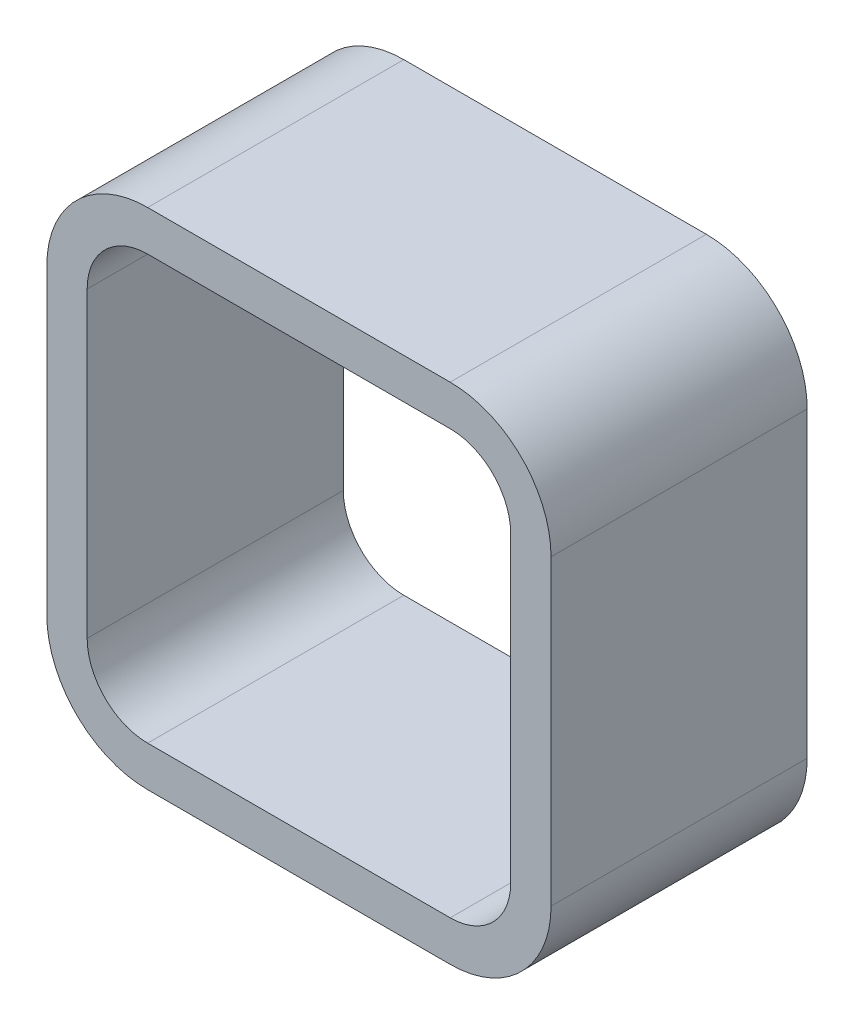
ISO-10303-21;
HEADER;
FILE_DESCRIPTION(('STEP AP214'),'2;1');
FILE_NAME('part.step','',(''),(''),'','','');
FILE_SCHEMA(('AUTOMOTIVE_DESIGN { 1 0 10303 214 1 1 1 1 }'));
ENDSEC;
DATA;
#1=APPLICATION_CONTEXT('core data for automotive mechanical design processes');
#2=APPLICATION_PROTOCOL_DEFINITION('international standard','automotive_design',2000,#1);
#3=PRODUCT_CONTEXT('',#1,'mechanical');
#4=PRODUCT('Part','Part','',(#3));
#5=PRODUCT_RELATED_PRODUCT_CATEGORY('part','',(#4));
#6=PRODUCT_DEFINITION_FORMATION('','',#4);
#7=PRODUCT_DEFINITION_CONTEXT('part definition',#1,'design');
#8=PRODUCT_DEFINITION('design','',#6,#7);
#9=PRODUCT_DEFINITION_SHAPE('','',#8);
#10=(LENGTH_UNIT() NAMED_UNIT(*) SI_UNIT(.MILLI.,.METRE.));
#11=(NAMED_UNIT(*) PLANE_ANGLE_UNIT() SI_UNIT($,.RADIAN.));
#12=(NAMED_UNIT(*) SI_UNIT($,.STERADIAN.) SOLID_ANGLE_UNIT());
#13=UNCERTAINTY_MEASURE_WITH_UNIT(LENGTH_MEASURE(1.E-05),#10,'distance_accuracy_value','');
#14=(GEOMETRIC_REPRESENTATION_CONTEXT(3) GLOBAL_UNCERTAINTY_ASSIGNED_CONTEXT((#13)) GLOBAL_UNIT_ASSIGNED_CONTEXT((#10,
#11,#12)) REPRESENTATION_CONTEXT('',''));
#15=CARTESIAN_POINT('',(0.,0.,0.));
#16=DIRECTION('',(0.,0.,1.));
#17=DIRECTION('',(1.,0.,0.));
#18=AXIS2_PLACEMENT_3D('',#15,#16,#17);
#19=CARTESIAN_POINT('',(-15.,15.,12.7));
#20=DIRECTION('',(0.,0.,-1.));
#21=DIRECTION('',(-1.,0.,0.));
#22=AXIS2_PLACEMENT_3D('',#19,#20,#21);
#23=PLANE('',#22);
#24=CARTESIAN_POINT('',(-15.,15.,12.7));
#25=DIRECTION('',(0.,0.,1.));
#26=DIRECTION('',(-1.,0.,0.));
#27=AXIS2_PLACEMENT_3D('',#24,#25,#26);
#28=CIRCLE('',#27,10.);
#29=CARTESIAN_POINT('',(-15.,25.,12.7));
#30=VERTEX_POINT('',#29);
#31=CARTESIAN_POINT('',(-25.,15.,12.7));
#32=VERTEX_POINT('',#31);
#33=EDGE_CURVE('E219',#30,#32,#28,.T.);
#34=ORIENTED_EDGE('',*,*,#33,.T.);
#35=DIRECTION('',(0.,-1.,0.));
#36=VECTOR('',#35,1.);
#37=CARTESIAN_POINT('',(-25.,-15.,12.7));
#38=LINE('',#37,#36);
#39=CARTESIAN_POINT('',(-25.,-15.,12.7));
#40=VERTEX_POINT('',#39);
#41=EDGE_CURVE('E218',#32,#40,#38,.T.);
#42=ORIENTED_EDGE('',*,*,#41,.T.);
#43=CARTESIAN_POINT('',(-15.,-15.,12.7));
#44=DIRECTION('',(0.,0.,1.));
#45=DIRECTION('',(-1.,0.,0.));
#46=AXIS2_PLACEMENT_3D('',#43,#44,#45);
#47=CIRCLE('',#46,10.);
#48=CARTESIAN_POINT('',(-15.,-25.,12.7));
#49=VERTEX_POINT('',#48);
#50=EDGE_CURVE('E222',#40,#49,#47,.T.);
#51=ORIENTED_EDGE('',*,*,#50,.T.);
#52=DIRECTION('',(1.,0.,0.));
#53=VECTOR('',#52,1.);
#54=CARTESIAN_POINT('',(-15.,-25.,12.7));
#55=LINE('',#54,#53);
#56=CARTESIAN_POINT('',(15.,-25.,12.7));
#57=VERTEX_POINT('',#56);
#58=EDGE_CURVE('E221',#49,#57,#55,.T.);
#59=ORIENTED_EDGE('',*,*,#58,.T.);
#60=CARTESIAN_POINT('',(15.,-15.,12.7));
#61=DIRECTION('',(0.,0.,1.));
#62=DIRECTION('',(1.,0.,0.));
#63=AXIS2_PLACEMENT_3D('',#60,#61,#62);
#64=CIRCLE('',#63,10.);
#65=CARTESIAN_POINT('',(25.,-15.,12.7));
#66=VERTEX_POINT('',#65);
#67=EDGE_CURVE('E227',#57,#66,#64,.T.);
#68=ORIENTED_EDGE('',*,*,#67,.T.);
#69=DIRECTION('',(0.,1.,0.));
#70=VECTOR('',#69,1.);
#71=CARTESIAN_POINT('',(25.,-15.,12.7));
#72=LINE('',#71,#70);
#73=CARTESIAN_POINT('',(25.,15.,12.7));
#74=VERTEX_POINT('',#73);
#75=EDGE_CURVE('E230',#66,#74,#72,.T.);
#76=ORIENTED_EDGE('',*,*,#75,.T.);
#77=CARTESIAN_POINT('',(15.,15.,12.7));
#78=DIRECTION('',(0.,0.,1.));
#79=DIRECTION('',(-1.,0.,0.));
#80=AXIS2_PLACEMENT_3D('',#77,#78,#79);
#81=CIRCLE('',#80,10.);
#82=CARTESIAN_POINT('',(15.,25.,12.7));
#83=VERTEX_POINT('',#82);
#84=EDGE_CURVE('E233',#74,#83,#81,.T.);
#85=ORIENTED_EDGE('',*,*,#84,.T.);
#86=DIRECTION('',(-1.,0.,0.));
#87=VECTOR('',#86,1.);
#88=CARTESIAN_POINT('',(-15.,25.,12.7));
#89=LINE('',#88,#87);
#90=EDGE_CURVE('E231',#83,#30,#89,.T.);
#91=ORIENTED_EDGE('',*,*,#90,.T.);
#92=EDGE_LOOP('',(#34,#42,#51,#59,#68,#76,#85,#91));
#93=FACE_BOUND('',#92,.T.);
#94=CARTESIAN_POINT('',(-15.,15.,12.7));
#95=DIRECTION('',(0.,0.,1.));
#96=DIRECTION('',(-1.,0.,0.));
#97=AXIS2_PLACEMENT_3D('',#94,#95,#96);
#98=CIRCLE('',#97,6.);
#99=CARTESIAN_POINT('',(-15.,21.,12.7));
#100=VERTEX_POINT('',#99);
#101=CARTESIAN_POINT('',(-21.,15.,12.7));
#102=VERTEX_POINT('',#101);
#103=EDGE_CURVE('E154',#100,#102,#98,.T.);
#104=ORIENTED_EDGE('',*,*,#103,.F.);
#105=DIRECTION('',(-1.,0.,0.));
#106=VECTOR('',#105,1.);
#107=CARTESIAN_POINT('',(-15.,21.,12.7));
#108=LINE('',#107,#106);
#109=CARTESIAN_POINT('',(15.,21.,12.7));
#110=VERTEX_POINT('',#109);
#111=EDGE_CURVE('E184',#110,#100,#108,.T.);
#112=ORIENTED_EDGE('',*,*,#111,.F.);
#113=CARTESIAN_POINT('',(15.,15.,12.7));
#114=DIRECTION('',(0.,0.,1.));
#115=DIRECTION('',(-1.,0.,0.));
#116=AXIS2_PLACEMENT_3D('',#113,#114,#115);
#117=CIRCLE('',#116,6.);
#118=CARTESIAN_POINT('',(21.,15.,12.7));
#119=VERTEX_POINT('',#118);
#120=EDGE_CURVE('E182',#119,#110,#117,.T.);
#121=ORIENTED_EDGE('',*,*,#120,.F.);
#122=DIRECTION('',(0.,1.,0.));
#123=VECTOR('',#122,1.);
#124=CARTESIAN_POINT('',(21.,-15.,12.7));
#125=LINE('',#124,#123);
#126=CARTESIAN_POINT('',(21.,-15.,12.7));
#127=VERTEX_POINT('',#126);
#128=EDGE_CURVE('E181',#127,#119,#125,.T.);
#129=ORIENTED_EDGE('',*,*,#128,.F.);
#130=CARTESIAN_POINT('',(15.,-15.,12.7));
#131=DIRECTION('',(0.,0.,1.));
#132=DIRECTION('',(1.,0.,0.));
#133=AXIS2_PLACEMENT_3D('',#130,#131,#132);
#134=CIRCLE('',#133,6.);
#135=CARTESIAN_POINT('',(15.,-21.,12.7));
#136=VERTEX_POINT('',#135);
#137=EDGE_CURVE('E177',#136,#127,#134,.T.);
#138=ORIENTED_EDGE('',*,*,#137,.F.);
#139=DIRECTION('',(1.,0.,0.));
#140=VECTOR('',#139,1.);
#141=CARTESIAN_POINT('',(-15.,-21.,12.7));
#142=LINE('',#141,#140);
#143=CARTESIAN_POINT('',(-15.,-21.,12.7));
#144=VERTEX_POINT('',#143);
#145=EDGE_CURVE('E174',#144,#136,#142,.T.);
#146=ORIENTED_EDGE('',*,*,#145,.F.);
#147=CARTESIAN_POINT('',(-15.,-15.,12.7));
#148=DIRECTION('',(0.,0.,1.));
#149=DIRECTION('',(-1.,0.,0.));
#150=AXIS2_PLACEMENT_3D('',#147,#148,#149);
#151=CIRCLE('',#150,6.);
#152=CARTESIAN_POINT('',(-21.,-15.,12.7));
#153=VERTEX_POINT('',#152);
#154=EDGE_CURVE('E173',#153,#144,#151,.T.);
#155=ORIENTED_EDGE('',*,*,#154,.F.);
#156=DIRECTION('',(0.,-1.,0.));
#157=VECTOR('',#156,1.);
#158=CARTESIAN_POINT('',(-21.,-15.,12.7));
#159=LINE('',#158,#157);
#160=EDGE_CURVE('E156',#102,#153,#159,.T.);
#161=ORIENTED_EDGE('',*,*,#160,.F.);
#162=EDGE_LOOP('',(#104,#112,#121,#129,#138,#146,#155,#161));
#163=FACE_BOUND('',#162,.T.);
#164=ADVANCED_FACE('F39',(#93,#163),#23,.F.);
#165=CARTESIAN_POINT('',(-15.,15.,-12.7));
#166=DIRECTION('',(0.,0.,-1.));
#167=DIRECTION('',(-1.,0.,0.));
#168=AXIS2_PLACEMENT_3D('',#165,#166,#167);
#169=PLANE('',#168);
#170=CARTESIAN_POINT('',(-15.,15.,-12.7));
#171=DIRECTION('',(0.,0.,1.));
#172=DIRECTION('',(-1.,0.,0.));
#173=AXIS2_PLACEMENT_3D('',#170,#171,#172);
#174=CIRCLE('',#173,10.);
#175=CARTESIAN_POINT('',(-15.,25.,-12.7));
#176=VERTEX_POINT('',#175);
#177=CARTESIAN_POINT('',(-25.,15.,-12.7));
#178=VERTEX_POINT('',#177);
#179=EDGE_CURVE('E166',#176,#178,#174,.T.);
#180=ORIENTED_EDGE('',*,*,#179,.F.);
#181=DIRECTION('',(-1.,0.,0.));
#182=VECTOR('',#181,1.);
#183=CARTESIAN_POINT('',(-15.,25.,-12.7));
#184=LINE('',#183,#182);
#185=CARTESIAN_POINT('',(15.,25.,-12.7));
#186=VERTEX_POINT('',#185);
#187=EDGE_CURVE('E223',#186,#176,#184,.T.);
#188=ORIENTED_EDGE('',*,*,#187,.F.);
#189=CARTESIAN_POINT('',(15.,15.,-12.7));
#190=DIRECTION('',(0.,0.,1.));
#191=DIRECTION('',(-1.,0.,0.));
#192=AXIS2_PLACEMENT_3D('',#189,#190,#191);
#193=CIRCLE('',#192,10.);
#194=CARTESIAN_POINT('',(25.,15.,-12.7));
#195=VERTEX_POINT('',#194);
#196=EDGE_CURVE('E247',#195,#186,#193,.T.);
#197=ORIENTED_EDGE('',*,*,#196,.F.);
#198=DIRECTION('',(0.,1.,0.));
#199=VECTOR('',#198,1.);
#200=CARTESIAN_POINT('',(25.,-15.,-12.7));
#201=LINE('',#200,#199);
#202=CARTESIAN_POINT('',(25.,-15.,-12.7));
#203=VERTEX_POINT('',#202);
#204=EDGE_CURVE('E246',#203,#195,#201,.T.);
#205=ORIENTED_EDGE('',*,*,#204,.F.);
#206=CARTESIAN_POINT('',(15.,-15.,-12.7));
#207=DIRECTION('',(0.,0.,1.));
#208=DIRECTION('',(1.,0.,0.));
#209=AXIS2_PLACEMENT_3D('',#206,#207,#208);
#210=CIRCLE('',#209,10.);
#211=CARTESIAN_POINT('',(15.,-25.,-12.7));
#212=VERTEX_POINT('',#211);
#213=EDGE_CURVE('E242',#212,#203,#210,.T.);
#214=ORIENTED_EDGE('',*,*,#213,.F.);
#215=DIRECTION('',(1.,0.,0.));
#216=VECTOR('',#215,1.);
#217=CARTESIAN_POINT('',(-15.,-25.,-12.7));
#218=LINE('',#217,#216);
#219=CARTESIAN_POINT('',(-15.,-25.,-12.7));
#220=VERTEX_POINT('',#219);
#221=EDGE_CURVE('E245',#220,#212,#218,.T.);
#222=ORIENTED_EDGE('',*,*,#221,.F.);
#223=CARTESIAN_POINT('',(-15.,-15.,-12.7));
#224=DIRECTION('',(0.,0.,1.));
#225=DIRECTION('',(-1.,0.,0.));
#226=AXIS2_PLACEMENT_3D('',#223,#224,#225);
#227=CIRCLE('',#226,10.);
#228=CARTESIAN_POINT('',(-25.,-15.,-12.7));
#229=VERTEX_POINT('',#228);
#230=EDGE_CURVE('E239',#229,#220,#227,.T.);
#231=ORIENTED_EDGE('',*,*,#230,.F.);
#232=DIRECTION('',(0.,-1.,0.));
#233=VECTOR('',#232,1.);
#234=CARTESIAN_POINT('',(-25.,-15.,-12.7));
#235=LINE('',#234,#233);
#236=EDGE_CURVE('E238',#178,#229,#235,.T.);
#237=ORIENTED_EDGE('',*,*,#236,.F.);
#238=EDGE_LOOP('',(#180,#188,#197,#205,#214,#222,#231,#237));
#239=FACE_BOUND('',#238,.T.);
#240=DIRECTION('',(-1.,0.,0.));
#241=VECTOR('',#240,1.);
#242=CARTESIAN_POINT('',(-15.,21.,-12.7));
#243=LINE('',#242,#241);
#244=CARTESIAN_POINT('',(15.,21.,-12.7));
#245=VERTEX_POINT('',#244);
#246=CARTESIAN_POINT('',(-15.,21.,-12.7));
#247=VERTEX_POINT('',#246);
#248=EDGE_CURVE('E163',#245,#247,#243,.T.);
#249=ORIENTED_EDGE('',*,*,#248,.T.);
#250=CARTESIAN_POINT('',(-15.,15.,-12.7));
#251=DIRECTION('',(0.,0.,1.));
#252=DIRECTION('',(-1.,0.,0.));
#253=AXIS2_PLACEMENT_3D('',#250,#251,#252);
#254=CIRCLE('',#253,6.);
#255=CARTESIAN_POINT('',(-21.,15.,-12.7));
#256=VERTEX_POINT('',#255);
#257=EDGE_CURVE('E65',#247,#256,#254,.T.);
#258=ORIENTED_EDGE('',*,*,#257,.T.);
#259=DIRECTION('',(0.,-1.,0.));
#260=VECTOR('',#259,1.);
#261=CARTESIAN_POINT('',(-21.,-15.,-12.7));
#262=LINE('',#261,#260);
#263=CARTESIAN_POINT('',(-21.,-15.,-12.7));
#264=VERTEX_POINT('',#263);
#265=EDGE_CURVE('E170',#256,#264,#262,.T.);
#266=ORIENTED_EDGE('',*,*,#265,.T.);
#267=CARTESIAN_POINT('',(-15.,-15.,-12.7));
#268=DIRECTION('',(0.,0.,1.));
#269=DIRECTION('',(-1.,0.,0.));
#270=AXIS2_PLACEMENT_3D('',#267,#268,#269);
#271=CIRCLE('',#270,6.);
#272=CARTESIAN_POINT('',(-15.,-21.,-12.7));
#273=VERTEX_POINT('',#272);
#274=EDGE_CURVE('E186',#264,#273,#271,.T.);
#275=ORIENTED_EDGE('',*,*,#274,.T.);
#276=DIRECTION('',(1.,0.,0.));
#277=VECTOR('',#276,1.);
#278=CARTESIAN_POINT('',(-15.,-21.,-12.7));
#279=LINE('',#278,#277);
#280=CARTESIAN_POINT('',(15.,-21.,-12.7));
#281=VERTEX_POINT('',#280);
#282=EDGE_CURVE('E195',#273,#281,#279,.T.);
#283=ORIENTED_EDGE('',*,*,#282,.T.);
#284=CARTESIAN_POINT('',(15.,-15.,-12.7));
#285=DIRECTION('',(0.,0.,1.));
#286=DIRECTION('',(1.,0.,0.));
#287=AXIS2_PLACEMENT_3D('',#284,#285,#286);
#288=CIRCLE('',#287,6.);
#289=CARTESIAN_POINT('',(21.,-15.,-12.7));
#290=VERTEX_POINT('',#289);
#291=EDGE_CURVE('E193',#281,#290,#288,.T.);
#292=ORIENTED_EDGE('',*,*,#291,.T.);
#293=DIRECTION('',(0.,1.,0.));
#294=VECTOR('',#293,1.);
#295=CARTESIAN_POINT('',(21.,-15.,-12.7));
#296=LINE('',#295,#294);
#297=CARTESIAN_POINT('',(21.,15.,-12.7));
#298=VERTEX_POINT('',#297);
#299=EDGE_CURVE('E200',#290,#298,#296,.T.);
#300=ORIENTED_EDGE('',*,*,#299,.T.);
#301=CARTESIAN_POINT('',(15.,15.,-12.7));
#302=DIRECTION('',(0.,0.,1.));
#303=DIRECTION('',(-1.,0.,0.));
#304=AXIS2_PLACEMENT_3D('',#301,#302,#303);
#305=CIRCLE('',#304,6.);
#306=EDGE_CURVE('E203',#298,#245,#305,.T.);
#307=ORIENTED_EDGE('',*,*,#306,.T.);
#308=EDGE_LOOP('',(#249,#258,#266,#275,#283,#292,#300,#307));
#309=FACE_BOUND('',#308,.T.);
#310=ADVANCED_FACE('F279',(#239,#309),#169,.T.);
#311=CARTESIAN_POINT('',(-15.,15.,12.7));
#312=DIRECTION('',(0.,0.,-1.));
#313=DIRECTION('',(-1.,0.,0.));
#314=AXIS2_PLACEMENT_3D('',#311,#312,#313);
#315=CYLINDRICAL_SURFACE('',#314,10.);
#316=ORIENTED_EDGE('',*,*,#179,.T.);
#317=DIRECTION('',(0.,0.,-1.));
#318=VECTOR('',#317,1.);
#319=CARTESIAN_POINT('',(-25.,15.,12.7));
#320=LINE('',#319,#318);
#321=EDGE_CURVE('E11',#32,#178,#320,.T.);
#322=ORIENTED_EDGE('',*,*,#321,.F.);
#323=ORIENTED_EDGE('',*,*,#33,.F.);
#324=DIRECTION('',(0.,0.,-1.));
#325=VECTOR('',#324,1.);
#326=CARTESIAN_POINT('',(-15.,25.,12.7));
#327=LINE('',#326,#325);
#328=EDGE_CURVE('E232',#30,#176,#327,.T.);
#329=ORIENTED_EDGE('',*,*,#328,.T.);
#330=EDGE_LOOP('',(#316,#322,#323,#329));
#331=FACE_BOUND('',#330,.T.);
#332=ADVANCED_FACE('F41',(#331),#315,.T.);
#333=CARTESIAN_POINT('',(-25.,-15.,12.7));
#334=DIRECTION('',(1.,0.,0.));
#335=DIRECTION('',(0.,0.,-1.));
#336=AXIS2_PLACEMENT_3D('',#333,#334,#335);
#337=PLANE('',#336);
#338=ORIENTED_EDGE('',*,*,#236,.T.);
#339=DIRECTION('',(0.,0.,-1.));
#340=VECTOR('',#339,1.);
#341=CARTESIAN_POINT('',(-25.,-15.,12.7));
#342=LINE('',#341,#340);
#343=EDGE_CURVE('E50',#40,#229,#342,.T.);
#344=ORIENTED_EDGE('',*,*,#343,.F.);
#345=ORIENTED_EDGE('',*,*,#41,.F.);
#346=ORIENTED_EDGE('',*,*,#321,.T.);
#347=EDGE_LOOP('',(#338,#344,#345,#346));
#348=FACE_BOUND('',#347,.T.);
#349=ADVANCED_FACE('F294',(#348),#337,.F.);
#350=CARTESIAN_POINT('',(-15.,-15.,12.7));
#351=DIRECTION('',(0.,0.,-1.));
#352=DIRECTION('',(-1.,0.,0.));
#353=AXIS2_PLACEMENT_3D('',#350,#351,#352);
#354=CYLINDRICAL_SURFACE('',#353,10.);
#355=ORIENTED_EDGE('',*,*,#230,.T.);
#356=DIRECTION('',(0.,0.,-1.));
#357=VECTOR('',#356,1.);
#358=CARTESIAN_POINT('',(-15.,-25.,12.7));
#359=LINE('',#358,#357);
#360=EDGE_CURVE('E263',#49,#220,#359,.T.);
#361=ORIENTED_EDGE('',*,*,#360,.F.);
#362=ORIENTED_EDGE('',*,*,#50,.F.);
#363=ORIENTED_EDGE('',*,*,#343,.T.);
#364=EDGE_LOOP('',(#355,#361,#362,#363));
#365=FACE_BOUND('',#364,.T.);
#366=ADVANCED_FACE('F275',(#365),#354,.T.);
#367=CARTESIAN_POINT('',(-15.,-25.,12.7));
#368=DIRECTION('',(0.,1.,0.));
#369=DIRECTION('',(-1.,0.,0.));
#370=AXIS2_PLACEMENT_3D('',#367,#368,#369);
#371=PLANE('',#370);
#372=ORIENTED_EDGE('',*,*,#221,.T.);
#373=DIRECTION('',(0.,0.,-1.));
#374=VECTOR('',#373,1.);
#375=CARTESIAN_POINT('',(15.,-25.,12.7));
#376=LINE('',#375,#374);
#377=EDGE_CURVE('E264',#57,#212,#376,.T.);
#378=ORIENTED_EDGE('',*,*,#377,.F.);
#379=ORIENTED_EDGE('',*,*,#58,.F.);
#380=ORIENTED_EDGE('',*,*,#360,.T.);
#381=EDGE_LOOP('',(#372,#378,#379,#380));
#382=FACE_BOUND('',#381,.T.);
#383=ADVANCED_FACE('F281',(#382),#371,.F.);
#384=CARTESIAN_POINT('',(15.,-15.,12.7));
#385=DIRECTION('',(0.,0.,-1.));
#386=DIRECTION('',(-1.,0.,0.));
#387=AXIS2_PLACEMENT_3D('',#384,#385,#386);
#388=CYLINDRICAL_SURFACE('',#387,10.);
#389=ORIENTED_EDGE('',*,*,#213,.T.);
#390=DIRECTION('',(0.,0.,-1.));
#391=VECTOR('',#390,1.);
#392=CARTESIAN_POINT('',(25.,-15.,12.7));
#393=LINE('',#392,#391);
#394=EDGE_CURVE('E256',#66,#203,#393,.T.);
#395=ORIENTED_EDGE('',*,*,#394,.F.);
#396=ORIENTED_EDGE('',*,*,#67,.F.);
#397=ORIENTED_EDGE('',*,*,#377,.T.);
#398=EDGE_LOOP('',(#389,#395,#396,#397));
#399=FACE_BOUND('',#398,.T.);
#400=ADVANCED_FACE('F287',(#399),#388,.T.);
#401=CARTESIAN_POINT('',(25.,-15.,12.7));
#402=DIRECTION('',(-1.,0.,0.));
#403=DIRECTION('',(0.,-1.,0.));
#404=AXIS2_PLACEMENT_3D('',#401,#402,#403);
#405=PLANE('',#404);
#406=ORIENTED_EDGE('',*,*,#204,.T.);
#407=DIRECTION('',(0.,0.,-1.));
#408=VECTOR('',#407,1.);
#409=CARTESIAN_POINT('',(25.,15.,12.7));
#410=LINE('',#409,#408);
#411=EDGE_CURVE('E257',#74,#195,#410,.T.);
#412=ORIENTED_EDGE('',*,*,#411,.F.);
#413=ORIENTED_EDGE('',*,*,#75,.F.);
#414=ORIENTED_EDGE('',*,*,#394,.T.);
#415=EDGE_LOOP('',(#406,#412,#413,#414));
#416=FACE_BOUND('',#415,.T.);
#417=ADVANCED_FACE('F308',(#416),#405,.F.);
#418=CARTESIAN_POINT('',(15.,15.,12.7));
#419=DIRECTION('',(0.,0.,-1.));
#420=DIRECTION('',(-1.,0.,0.));
#421=AXIS2_PLACEMENT_3D('',#418,#419,#420);
#422=CYLINDRICAL_SURFACE('',#421,10.);
#423=ORIENTED_EDGE('',*,*,#196,.T.);
#424=DIRECTION('',(0.,0.,-1.));
#425=VECTOR('',#424,1.);
#426=CARTESIAN_POINT('',(15.,25.,12.7));
#427=LINE('',#426,#425);
#428=EDGE_CURVE('E254',#83,#186,#427,.T.);
#429=ORIENTED_EDGE('',*,*,#428,.F.);
#430=ORIENTED_EDGE('',*,*,#84,.F.);
#431=ORIENTED_EDGE('',*,*,#411,.T.);
#432=EDGE_LOOP('',(#423,#429,#430,#431));
#433=FACE_BOUND('',#432,.T.);
#434=ADVANCED_FACE('F306',(#433),#422,.T.);
#435=CARTESIAN_POINT('',(-15.,25.,12.7));
#436=DIRECTION('',(0.,-1.,0.));
#437=DIRECTION('',(0.,0.,-1.));
#438=AXIS2_PLACEMENT_3D('',#435,#436,#437);
#439=PLANE('',#438);
#440=ORIENTED_EDGE('',*,*,#187,.T.);
#441=ORIENTED_EDGE('',*,*,#328,.F.);
#442=ORIENTED_EDGE('',*,*,#90,.F.);
#443=ORIENTED_EDGE('',*,*,#428,.T.);
#444=EDGE_LOOP('',(#440,#441,#442,#443));
#445=FACE_BOUND('',#444,.T.);
#446=ADVANCED_FACE('F301',(#445),#439,.F.);
#447=CARTESIAN_POINT('',(-15.,15.,12.7));
#448=DIRECTION('',(0.,0.,-1.));
#449=DIRECTION('',(-1.,0.,0.));
#450=AXIS2_PLACEMENT_3D('',#447,#448,#449);
#451=CYLINDRICAL_SURFACE('',#450,6.);
#452=ORIENTED_EDGE('',*,*,#257,.F.);
#453=DIRECTION('',(0.,0.,-1.));
#454=VECTOR('',#453,1.);
#455=CARTESIAN_POINT('',(-15.,21.,12.7));
#456=LINE('',#455,#454);
#457=EDGE_CURVE('E158',#100,#247,#456,.T.);
#458=ORIENTED_EDGE('',*,*,#457,.F.);
#459=ORIENTED_EDGE('',*,*,#103,.T.);
#460=DIRECTION('',(0.,0.,-1.));
#461=VECTOR('',#460,1.);
#462=CARTESIAN_POINT('',(-21.,15.,12.7));
#463=LINE('',#462,#461);
#464=EDGE_CURVE('E153',#102,#256,#463,.T.);
#465=ORIENTED_EDGE('',*,*,#464,.T.);
#466=EDGE_LOOP('',(#452,#458,#459,#465));
#467=FACE_BOUND('',#466,.T.);
#468=ADVANCED_FACE('F151',(#467),#451,.F.);
#469=CARTESIAN_POINT('',(-21.,-15.,12.7));
#470=DIRECTION('',(1.,0.,0.));
#471=DIRECTION('',(0.,0.,-1.));
#472=AXIS2_PLACEMENT_3D('',#469,#470,#471);
#473=PLANE('',#472);
#474=ORIENTED_EDGE('',*,*,#265,.F.);
#475=ORIENTED_EDGE('',*,*,#464,.F.);
#476=ORIENTED_EDGE('',*,*,#160,.T.);
#477=DIRECTION('',(0.,0.,-1.));
#478=VECTOR('',#477,1.);
#479=CARTESIAN_POINT('',(-21.,-15.,12.7));
#480=LINE('',#479,#478);
#481=EDGE_CURVE('E169',#153,#264,#480,.T.);
#482=ORIENTED_EDGE('',*,*,#481,.T.);
#483=EDGE_LOOP('',(#474,#475,#476,#482));
#484=FACE_BOUND('',#483,.T.);
#485=ADVANCED_FACE('F165',(#484),#473,.T.);
#486=CARTESIAN_POINT('',(-15.,-15.,12.7));
#487=DIRECTION('',(0.,0.,-1.));
#488=DIRECTION('',(-1.,0.,0.));
#489=AXIS2_PLACEMENT_3D('',#486,#487,#488);
#490=CYLINDRICAL_SURFACE('',#489,6.);
#491=ORIENTED_EDGE('',*,*,#274,.F.);
#492=ORIENTED_EDGE('',*,*,#481,.F.);
#493=ORIENTED_EDGE('',*,*,#154,.T.);
#494=DIRECTION('',(0.,0.,-1.));
#495=VECTOR('',#494,1.);
#496=CARTESIAN_POINT('',(-15.,-21.,12.7));
#497=LINE('',#496,#495);
#498=EDGE_CURVE('E211',#144,#273,#497,.T.);
#499=ORIENTED_EDGE('',*,*,#498,.T.);
#500=EDGE_LOOP('',(#491,#492,#493,#499));
#501=FACE_BOUND('',#500,.T.);
#502=ADVANCED_FACE('F332',(#501),#490,.F.);
#503=CARTESIAN_POINT('',(-15.,-21.,12.7));
#504=DIRECTION('',(0.,1.,0.));
#505=DIRECTION('',(0.,0.,1.));
#506=AXIS2_PLACEMENT_3D('',#503,#504,#505);
#507=PLANE('',#506);
#508=ORIENTED_EDGE('',*,*,#282,.F.);
#509=ORIENTED_EDGE('',*,*,#498,.F.);
#510=ORIENTED_EDGE('',*,*,#145,.T.);
#511=DIRECTION('',(0.,0.,-1.));
#512=VECTOR('',#511,1.);
#513=CARTESIAN_POINT('',(15.,-21.,12.7));
#514=LINE('',#513,#512);
#515=EDGE_CURVE('E215',#136,#281,#514,.T.);
#516=ORIENTED_EDGE('',*,*,#515,.T.);
#517=EDGE_LOOP('',(#508,#509,#510,#516));
#518=FACE_BOUND('',#517,.T.);
#519=ADVANCED_FACE('F340',(#518),#507,.T.);
#520=CARTESIAN_POINT('',(15.,-15.,12.7));
#521=DIRECTION('',(0.,0.,-1.));
#522=DIRECTION('',(-1.,0.,0.));
#523=AXIS2_PLACEMENT_3D('',#520,#521,#522);
#524=CYLINDRICAL_SURFACE('',#523,6.);
#525=ORIENTED_EDGE('',*,*,#291,.F.);
#526=ORIENTED_EDGE('',*,*,#515,.F.);
#527=ORIENTED_EDGE('',*,*,#137,.T.);
#528=DIRECTION('',(0.,0.,-1.));
#529=VECTOR('',#528,1.);
#530=CARTESIAN_POINT('',(21.,-15.,12.7));
#531=LINE('',#530,#529);
#532=EDGE_CURVE('E208',#127,#290,#531,.T.);
#533=ORIENTED_EDGE('',*,*,#532,.T.);
#534=EDGE_LOOP('',(#525,#526,#527,#533));
#535=FACE_BOUND('',#534,.T.);
#536=ADVANCED_FACE('F344',(#535),#524,.F.);
#537=CARTESIAN_POINT('',(21.,-15.,12.7));
#538=DIRECTION('',(-1.,0.,0.));
#539=DIRECTION('',(0.,0.,1.));
#540=AXIS2_PLACEMENT_3D('',#537,#538,#539);
#541=PLANE('',#540);
#542=ORIENTED_EDGE('',*,*,#299,.F.);
#543=ORIENTED_EDGE('',*,*,#532,.F.);
#544=ORIENTED_EDGE('',*,*,#128,.T.);
#545=DIRECTION('',(0.,0.,-1.));
#546=VECTOR('',#545,1.);
#547=CARTESIAN_POINT('',(21.,15.,12.7));
#548=LINE('',#547,#546);
#549=EDGE_CURVE('E206',#119,#298,#548,.T.);
#550=ORIENTED_EDGE('',*,*,#549,.T.);
#551=EDGE_LOOP('',(#542,#543,#544,#550));
#552=FACE_BOUND('',#551,.T.);
#553=ADVANCED_FACE('F349',(#552),#541,.T.);
#554=CARTESIAN_POINT('',(15.,15.,12.7));
#555=DIRECTION('',(0.,0.,-1.));
#556=DIRECTION('',(-1.,0.,0.));
#557=AXIS2_PLACEMENT_3D('',#554,#555,#556);
#558=CYLINDRICAL_SURFACE('',#557,6.);
#559=ORIENTED_EDGE('',*,*,#306,.F.);
#560=ORIENTED_EDGE('',*,*,#549,.F.);
#561=ORIENTED_EDGE('',*,*,#120,.T.);
#562=DIRECTION('',(0.,0.,-1.));
#563=VECTOR('',#562,1.);
#564=CARTESIAN_POINT('',(15.,21.,12.7));
#565=LINE('',#564,#563);
#566=EDGE_CURVE('E53',#110,#245,#565,.T.);
#567=ORIENTED_EDGE('',*,*,#566,.T.);
#568=EDGE_LOOP('',(#559,#560,#561,#567));
#569=FACE_BOUND('',#568,.T.);
#570=ADVANCED_FACE('F353',(#569),#558,.F.);
#571=CARTESIAN_POINT('',(-15.,21.,12.7));
#572=DIRECTION('',(0.,-1.,0.));
#573=DIRECTION('',(0.,0.,-1.));
#574=AXIS2_PLACEMENT_3D('',#571,#572,#573);
#575=PLANE('',#574);
#576=ORIENTED_EDGE('',*,*,#248,.F.);
#577=ORIENTED_EDGE('',*,*,#566,.F.);
#578=ORIENTED_EDGE('',*,*,#111,.T.);
#579=ORIENTED_EDGE('',*,*,#457,.T.);
#580=EDGE_LOOP('',(#576,#577,#578,#579));
#581=FACE_BOUND('',#580,.T.);
#582=ADVANCED_FACE('F351',(#581),#575,.T.);
#583=CLOSED_SHELL('',(#164,#310,#332,#349,#366,#383,#400,#417,#434,#446,#468,#485,#502,#519,
#536,#553,#570,#582));
#584=MANIFOLD_SOLID_BREP('B2',#583);
#585=ADVANCED_BREP_SHAPE_REPRESENTATION('',(#18,#584),#14);
#586=SHAPE_DEFINITION_REPRESENTATION(#9,#585);
ENDSEC;
END-ISO-10303-21;
